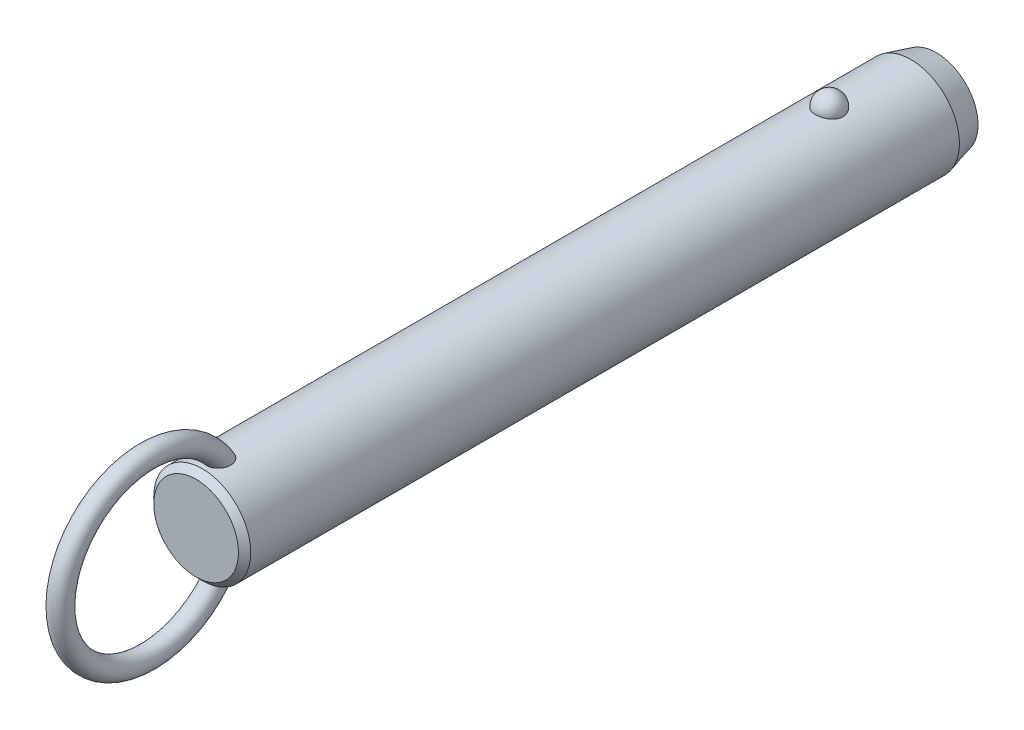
ISO-10303-21;
HEADER;
FILE_DESCRIPTION(('STEP AP214'),'2;1');
FILE_NAME('part.step','',(''),(''),'','','');
FILE_SCHEMA(('AUTOMOTIVE_DESIGN { 1 0 10303 214 1 1 1 1 }'));
ENDSEC;
DATA;
#1=APPLICATION_CONTEXT('core data for automotive mechanical design processes');
#2=APPLICATION_PROTOCOL_DEFINITION('international standard','automotive_design',2000,#1);
#3=PRODUCT_CONTEXT('',#1,'mechanical');
#4=PRODUCT('Part','Part','',(#3));
#5=PRODUCT_RELATED_PRODUCT_CATEGORY('part','',(#4));
#6=PRODUCT_DEFINITION_FORMATION('','',#4);
#7=PRODUCT_DEFINITION_CONTEXT('part definition',#1,'design');
#8=PRODUCT_DEFINITION('design','',#6,#7);
#9=PRODUCT_DEFINITION_SHAPE('','',#8);
#10=(LENGTH_UNIT() NAMED_UNIT(*) SI_UNIT(.MILLI.,.METRE.));
#11=(NAMED_UNIT(*) PLANE_ANGLE_UNIT() SI_UNIT($,.RADIAN.));
#12=(NAMED_UNIT(*) SI_UNIT($,.STERADIAN.) SOLID_ANGLE_UNIT());
#13=UNCERTAINTY_MEASURE_WITH_UNIT(LENGTH_MEASURE(1.E-05),#10,'distance_accuracy_value','');
#14=(GEOMETRIC_REPRESENTATION_CONTEXT(3) GLOBAL_UNCERTAINTY_ASSIGNED_CONTEXT((#13)) GLOBAL_UNIT_ASSIGNED_CONTEXT((#10,
#11,#12)) REPRESENTATION_CONTEXT('',''));
#15=CARTESIAN_POINT('',(0.,0.,0.));
#16=DIRECTION('',(0.,0.,1.));
#17=DIRECTION('',(1.,0.,0.));
#18=AXIS2_PLACEMENT_3D('',#15,#16,#17);
#19=CARTESIAN_POINT('',(0.,0.,111.8));
#20=DIRECTION('',(0.,0.,-1.));
#21=DIRECTION('',(-1.,0.,0.));
#22=AXIS2_PLACEMENT_3D('',#19,#20,#21);
#23=CYLINDRICAL_SURFACE('',#22,9.5);
#24=CARTESIAN_POINT('',(2.67259918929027,9.11631578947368,-2.70000000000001));
#25=CARTESIAN_POINT('',(2.6725968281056,9.11631786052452,-2.54909854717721));
#26=CARTESIAN_POINT('',(2.66030567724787,9.11994722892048,-2.39816735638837));
#27=CARTESIAN_POINT('',(2.6114347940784,9.13405924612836,-2.10058568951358));
#28=CARTESIAN_POINT('',(2.57484658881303,9.14454428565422,-1.95393672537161));
#29=CARTESIAN_POINT('',(2.47830875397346,9.17117631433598,-1.66916069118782));
#30=CARTESIAN_POINT('',(2.41836936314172,9.18732082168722,-1.53102991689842));
#31=CARTESIAN_POINT('',(2.27661331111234,9.22346780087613,-1.26705393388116));
#32=CARTESIAN_POINT('',(2.19479699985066,9.24347021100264,-1.14120852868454));
#33=CARTESIAN_POINT('',(2.01085282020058,9.28522401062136,-0.904632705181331));
#34=CARTESIAN_POINT('',(1.90862396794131,9.30698376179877,-0.793982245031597));
#35=CARTESIAN_POINT('',(1.6867437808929,9.34973971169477,-0.591607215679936));
#36=CARTESIAN_POINT('',(1.56709244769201,9.37073591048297,-0.499882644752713));
#37=CARTESIAN_POINT('',(1.31393976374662,9.40956370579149,-0.338167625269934));
#38=CARTESIAN_POINT('',(1.18048026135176,9.42740444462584,-0.268113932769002));
#39=CARTESIAN_POINT('',(0.903154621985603,9.45799906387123,-0.151390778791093));
#40=CARTESIAN_POINT('',(0.759289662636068,9.47075351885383,-0.104718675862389));
#41=CARTESIAN_POINT('',(0.468074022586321,9.48956256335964,-0.0367633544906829));
#42=CARTESIAN_POINT('',(0.320836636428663,9.49573643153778,-0.0150275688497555));
#43=CARTESIAN_POINT('',(0.0246714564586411,9.50112183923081,0.00396199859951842));
#44=CARTESIAN_POINT('',(-0.124256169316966,9.50033406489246,0.00121819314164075));
#45=CARTESIAN_POINT('',(-0.417264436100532,9.4919475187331,-0.0284441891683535));
#46=CARTESIAN_POINT('',(-0.56138413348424,9.48444885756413,-0.0550074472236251));
#47=CARTESIAN_POINT('',(-0.842986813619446,9.46357853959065,-0.131064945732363));
#48=CARTESIAN_POINT('',(-0.980469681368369,9.450206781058,-0.180559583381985));
#49=CARTESIAN_POINT('',(-1.24585005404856,9.41890822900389,-0.301476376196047));
#50=CARTESIAN_POINT('',(-1.37368611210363,9.40095498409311,-0.373026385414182));
#51=CARTESIAN_POINT('',(-1.61552738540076,9.36242964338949,-0.536025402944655));
#52=CARTESIAN_POINT('',(-1.72953116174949,9.34185727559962,-0.627476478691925));
#53=CARTESIAN_POINT('',(-1.9429225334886,9.29984568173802,-0.829844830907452));
#54=CARTESIAN_POINT('',(-2.04198021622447,9.27839736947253,-0.94110821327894));
#55=CARTESIAN_POINT('',(-2.22026460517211,9.23735994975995,-1.17883414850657));
#56=CARTESIAN_POINT('',(-2.29948985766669,9.21777097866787,-1.30529781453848));
#57=CARTESIAN_POINT('',(-2.43697287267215,9.18238994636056,-1.57158566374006));
#58=CARTESIAN_POINT('',(-2.49497068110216,9.16664569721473,-1.71155057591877));
#59=CARTESIAN_POINT('',(-2.5872073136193,9.14104303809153,-1.99961197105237));
#60=CARTESIAN_POINT('',(-2.62144683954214,9.13118445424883,-2.14770821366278));
#61=CARTESIAN_POINT('',(-2.66521466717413,9.11850622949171,-2.44715424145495));
#62=CARTESIAN_POINT('',(-2.67484831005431,9.11565658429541,-2.59848735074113));
#63=CARTESIAN_POINT('',(-2.66946735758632,9.11723375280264,-2.90067317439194));
#64=CARTESIAN_POINT('',(-2.65445345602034,9.12166036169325,-3.05152590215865));
#65=CARTESIAN_POINT('',(-2.60029711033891,9.13724422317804,-3.34766110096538));
#66=CARTESIAN_POINT('',(-2.56127978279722,9.14836656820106,-3.49296833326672));
#67=CARTESIAN_POINT('',(-2.46018844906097,9.17606676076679,-3.77477535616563));
#68=CARTESIAN_POINT('',(-2.39811349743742,9.1926448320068,-3.9112747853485));
#69=CARTESIAN_POINT('',(-2.25202303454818,9.22952198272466,-4.17244273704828));
#70=CARTESIAN_POINT('',(-2.16788714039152,9.24984129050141,-4.29704106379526));
#71=CARTESIAN_POINT('',(-1.9799408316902,9.29188255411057,-4.53013066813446));
#72=CARTESIAN_POINT('',(-1.87612963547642,9.31360456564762,-4.63862130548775));
#73=CARTESIAN_POINT('',(-1.65105429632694,9.35612959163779,-4.8369029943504));
#74=CARTESIAN_POINT('',(-1.52972405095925,9.37692871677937,-4.92661991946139));
#75=CARTESIAN_POINT('',(-1.27318250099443,9.41518970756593,-5.08429106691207));
#76=CARTESIAN_POINT('',(-1.13797219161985,9.432651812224,-5.15224684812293));
#77=CARTESIAN_POINT('',(-0.859280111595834,9.46208255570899,-5.26371827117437));
#78=CARTESIAN_POINT('',(-0.715925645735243,9.47411833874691,-5.30753421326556));
#79=CARTESIAN_POINT('',(-0.423550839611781,9.4916822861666,-5.37076321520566));
#80=CARTESIAN_POINT('',(-0.2745312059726,9.49721125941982,-5.39017930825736));
#81=CARTESIAN_POINT('',(0.0218446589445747,9.50110860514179,-5.40390587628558));
#82=CARTESIAN_POINT('',(0.16917707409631,9.49961381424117,-5.39869609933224));
#83=CARTESIAN_POINT('',(0.460808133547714,9.48993906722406,-5.36441955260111));
#84=CARTESIAN_POINT('',(0.605106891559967,9.48175936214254,-5.33535367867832));
#85=CARTESIAN_POINT('',(0.886027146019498,9.4596376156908,-5.25435587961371));
#86=CARTESIAN_POINT('',(1.02267710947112,9.44571881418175,-5.20251612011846));
#87=CARTESIAN_POINT('',(1.28523827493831,9.41358993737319,-5.07741549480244));
#88=CARTESIAN_POINT('',(1.41114877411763,9.39537958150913,-5.00415322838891));
#89=CARTESIAN_POINT('',(1.65085227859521,9.3562644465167,-4.83684599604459));
#90=CARTESIAN_POINT('',(1.76442346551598,9.33532178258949,-4.74249218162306));
#91=CARTESIAN_POINT('',(1.97425672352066,9.29321198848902,-4.53620389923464));
#92=CARTESIAN_POINT('',(2.07051582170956,9.27204482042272,-4.42426641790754));
#93=CARTESIAN_POINT('',(2.24490086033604,9.23139221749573,-4.18363183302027));
#94=CARTESIAN_POINT('',(2.32267019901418,9.21194380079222,-4.05466990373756));
#95=CARTESIAN_POINT('',(2.45584092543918,9.1773419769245,-3.78517836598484));
#96=CARTESIAN_POINT('',(2.5112497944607,9.16218713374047,-3.64465264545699));
#97=CARTESIAN_POINT('',(2.59380876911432,9.13913522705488,-3.37104301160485));
#98=CARTESIAN_POINT('',(2.62330266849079,9.13064624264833,-3.23871053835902));
#99=CARTESIAN_POINT('',(2.66269870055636,9.11923566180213,-2.97092664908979));
#100=CARTESIAN_POINT('',(2.67260130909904,9.11631393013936,-2.83547530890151));
#101=CARTESIAN_POINT('',(2.67259918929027,9.11631578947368,-2.70000000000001));
#102=B_SPLINE_CURVE_WITH_KNOTS('',3,(#24,#25,#26,#27,#28,#29,#30,#31,#32,#33,#34,#35,#36,#37,
#38,#39,#40,#41,#42,#43,#44,#45,#46,#47,#48,#49,#50,#51,#52,#53,#54,#55,#56,#57,#58,#59,#60,#61,
#62,#63,#64,#65,#66,#67,#68,#69,#70,#71,#72,#73,#74,#75,#76,#77,#78,#79,#80,#81,#82,#83,#84,#85,
#86,#87,#88,#89,#90,#91,#92,#93,#94,#95,#96,#97,#98,#99,#100,#101),.UNSPECIFIED.,.T.,.F.,(4,2,2,
2,2,2,2,2,2,2,2,2,2,2,2,2,2,2,2,2,2,2,2,2,2,2,2,2,2,2,2,2,2,2,2,2,2,2,4),(0.,0.452217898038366,
0.904593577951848,1.35677112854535,1.80894144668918,2.26340676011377,2.71787203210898,
3.17099820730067,3.62407318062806,4.0687883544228,4.51345969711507,4.95160616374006,
5.38976021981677,5.83050358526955,6.27129275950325,6.72071308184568,7.17016633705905,
7.62495278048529,8.07972578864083,8.53254856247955,8.98535859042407,9.43582813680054,
9.88631615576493,10.3393155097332,10.7923328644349,11.2471065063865,11.7018475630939,
12.150795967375,12.599688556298,13.0398725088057,13.4800399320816,13.9184421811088,
14.3568730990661,14.802202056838,15.2476074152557,15.7010097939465,16.1542603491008,
16.5602594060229,16.966248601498),.UNSPECIFIED.);
#103=CARTESIAN_POINT('',(2.67259918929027,9.11631578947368,-2.70000000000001));
#104=VERTEX_POINT('',#103);
#105=EDGE_CURVE('E41',#104,#104,#102,.T.);
#106=ORIENTED_EDGE('',*,*,#105,.T.);
#107=EDGE_LOOP('',(#106));
#108=FACE_BOUND('',#107,.T.);
#109=CARTESIAN_POINT('',(0.,0.,120.12));
#110=DIRECTION('',(0.,0.,1.));
#111=DIRECTION('',(1.,0.,0.));
#112=AXIS2_PLACEMENT_3D('',#109,#110,#111);
#113=CIRCLE('',#112,9.5);
#114=CARTESIAN_POINT('',(9.5,0.,120.12));
#115=VERTEX_POINT('',#114);
#116=EDGE_CURVE('E10',#115,#115,#113,.F.);
#117=ORIENTED_EDGE('',*,*,#116,.T.);
#118=EDGE_LOOP('',(#117));
#119=FACE_BOUND('',#118,.T.);
#120=CARTESIAN_POINT('',(-0.697062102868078,-9.47439269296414,114.467808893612));
#121=CARTESIAN_POINT('',(-0.799579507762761,-9.46685146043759,114.507482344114));
#122=CARTESIAN_POINT('',(-0.898575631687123,-9.45788043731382,114.5559309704));
#123=CARTESIAN_POINT('',(-1.08670047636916,-9.43811593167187,114.668868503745));
#124=CARTESIAN_POINT('',(-1.17583204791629,-9.42732297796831,114.733352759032));
#125=CARTESIAN_POINT('',(-1.34179806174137,-9.40513672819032,114.876209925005));
#126=CARTESIAN_POINT('',(-1.41865133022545,-9.39374438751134,114.954561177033));
#127=CARTESIAN_POINT('',(-1.55860047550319,-9.37154196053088,115.122752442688));
#128=CARTESIAN_POINT('',(-1.62169476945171,-9.3607319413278,115.21259377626));
#129=CARTESIAN_POINT('',(-1.73527695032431,-9.34035749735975,115.404500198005));
#130=CARTESIAN_POINT('',(-1.78522266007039,-9.33085270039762,115.506891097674));
#131=CARTESIAN_POINT('',(-1.86924997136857,-9.3143834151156,115.718148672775));
#132=CARTESIAN_POINT('',(-1.90332570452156,-9.30741986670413,115.827017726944));
#133=CARTESIAN_POINT('',(-1.95893603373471,-9.29588482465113,116.060473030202));
#134=CARTESIAN_POINT('',(-1.97872420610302,-9.29165182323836,116.185489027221));
#135=CARTESIAN_POINT('',(-2.00062129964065,-9.28695978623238,116.437080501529));
#136=CARTESIAN_POINT('',(-2.00272284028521,-9.28650232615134,116.563656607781));
#137=CARTESIAN_POINT('',(-1.98958876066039,-9.28932750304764,116.836815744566));
#138=CARTESIAN_POINT('',(-1.97143366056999,-9.2932400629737,116.983251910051));
#139=CARTESIAN_POINT('',(-1.91479925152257,-9.30507151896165,117.272062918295));
#140=CARTESIAN_POINT('',(-1.87629122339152,-9.31299607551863,117.414431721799));
#141=CARTESIAN_POINT('',(-1.7722568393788,-9.33340232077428,117.715172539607));
#142=CARTESIAN_POINT('',(-1.70334898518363,-9.34641636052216,117.872369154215));
#143=CARTESIAN_POINT('',(-1.58111062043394,-9.36759153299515,118.097517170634));
#144=CARTESIAN_POINT('',(-1.53721459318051,-9.37492619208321,118.170796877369));
#145=CARTESIAN_POINT('',(-1.4430263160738,-9.38988566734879,118.31307405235));
#146=CARTESIAN_POINT('',(-1.39273721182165,-9.39751033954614,118.382073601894));
#147=CARTESIAN_POINT('',(-1.26775962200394,-9.41530678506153,118.536983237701));
#148=CARTESIAN_POINT('',(-1.19052326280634,-9.42548108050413,118.620871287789));
#149=CARTESIAN_POINT('',(-1.0242024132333,-9.44499825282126,118.776008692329));
#150=CARTESIAN_POINT('',(-0.935139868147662,-9.45434261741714,118.847280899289));
#151=CARTESIAN_POINT('',(-0.766610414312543,-9.46930670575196,118.958695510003));
#152=CARTESIAN_POINT('',(-0.689439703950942,-9.47529223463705,119.002235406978));
#153=CARTESIAN_POINT('',(-0.528942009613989,-9.48560294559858,119.07631336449));
#154=CARTESIAN_POINT('',(-0.445620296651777,-9.48992953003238,119.106862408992));
#155=CARTESIAN_POINT('',(-0.273901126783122,-9.49644161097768,119.152579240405));
#156=CARTESIAN_POINT('',(-0.185465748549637,-9.49860811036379,119.16761059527));
#157=CARTESIAN_POINT('',(-0.00734541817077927,-9.5004135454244,119.180149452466));
#158=CARTESIAN_POINT('',(0.0823387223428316,-9.50005405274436,119.177667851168));
#159=CARTESIAN_POINT('',(0.247679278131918,-9.49708301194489,119.156995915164));
#160=CARTESIAN_POINT('',(0.32362017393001,-9.49477609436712,119.140930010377));
#161=CARTESIAN_POINT('',(0.47198153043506,-9.48855917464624,119.097172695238));
#162=CARTESIAN_POINT('',(0.54440029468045,-9.48464840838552,119.069475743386));
#163=CARTESIAN_POINT('',(0.708947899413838,-9.47398336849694,118.99280266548));
#164=CARTESIAN_POINT('',(0.799149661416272,-9.46671310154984,118.939774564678));
#165=CARTESIAN_POINT('',(0.969783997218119,-9.45076225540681,118.819973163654));
#166=CARTESIAN_POINT('',(1.05019415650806,-9.44207854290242,118.753169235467));
#167=CARTESIAN_POINT('',(1.23092343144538,-9.42051459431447,118.580759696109));
#168=CARTESIAN_POINT('',(1.32652499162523,-9.40733378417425,118.47026193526));
#169=CARTESIAN_POINT('',(1.49893121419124,-9.3814074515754,118.235561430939));
#170=CARTESIAN_POINT('',(1.57571616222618,-9.36866239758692,118.111344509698));
#171=CARTESIAN_POINT('',(1.71285426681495,-9.34457644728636,117.849389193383));
#172=CARTESIAN_POINT('',(1.7726636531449,-9.33328726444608,117.71136233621));
#173=CARTESIAN_POINT('',(1.87239208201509,-9.31379209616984,117.428051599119));
#174=CARTESIAN_POINT('',(1.91230158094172,-9.3055875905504,117.282764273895));
#175=CARTESIAN_POINT('',(1.97604189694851,-9.29228394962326,116.962028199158));
#176=CARTESIAN_POINT('',(1.99587438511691,-9.28797202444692,116.785724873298));
#177=CARTESIAN_POINT('',(2.0029570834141,-9.28645519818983,116.432414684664));
#178=CARTESIAN_POINT('',(1.99025930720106,-9.28923895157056,116.255409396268));
#179=CARTESIAN_POINT('',(1.93735479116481,-9.30038134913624,115.956338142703));
#180=CARTESIAN_POINT('',(1.90576827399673,-9.30697680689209,115.832667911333));
#181=CARTESIAN_POINT('',(1.82287484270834,-9.32356855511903,115.592329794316));
#182=CARTESIAN_POINT('',(1.77158213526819,-9.33356239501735,115.475656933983));
#183=CARTESIAN_POINT('',(1.64885744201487,-9.35602275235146,115.252706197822));
#184=CARTESIAN_POINT('',(1.57730995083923,-9.36850332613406,115.146492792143));
#185=CARTESIAN_POINT('',(1.41543264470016,-9.39431873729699,114.949553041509));
#186=CARTESIAN_POINT('',(1.3251088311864,-9.40765330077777,114.858821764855));
#187=CARTESIAN_POINT('',(1.13846223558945,-9.43195720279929,114.705033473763));
#188=CARTESIAN_POINT('',(1.04369890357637,-9.44302894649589,114.640094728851));
#189=CARTESIAN_POINT('',(0.84396568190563,-9.46296805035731,114.528038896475));
#190=CARTESIAN_POINT('',(0.73900000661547,-9.4718363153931,114.480914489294));
#191=CARTESIAN_POINT('',(0.528175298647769,-9.48586140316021,114.408117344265));
#192=CARTESIAN_POINT('',(0.422686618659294,-9.49119633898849,114.38140249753));
#193=CARTESIAN_POINT('',(0.208590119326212,-9.49831365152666,114.346013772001));
#194=CARTESIAN_POINT('',(0.0999817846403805,-9.500095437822,114.337342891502));
#195=CARTESIAN_POINT('',(-0.126104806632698,-9.49988861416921,114.338350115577));
#196=CARTESIAN_POINT('',(-0.243578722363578,-9.49757821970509,114.349594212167));
#197=CARTESIAN_POINT('',(-0.474390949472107,-9.48885165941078,114.393167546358));
#198=CARTESIAN_POINT('',(-0.587729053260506,-9.48243528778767,114.425497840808));
#199=CARTESIAN_POINT('',(-0.697062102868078,-9.47439269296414,114.467808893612));
#200=B_SPLINE_CURVE_WITH_KNOTS('',3,(#120,#121,#122,#123,#124,#125,#126,#127,#128,#129,#130,
#131,#132,#133,#134,#135,#136,#137,#138,#139,#140,#141,#142,#143,#144,#145,#146,#147,#148,#149,
#150,#151,#152,#153,#154,#155,#156,#157,#158,#159,#160,#161,#162,#163,#164,#165,#166,#167,#168,
#169,#170,#171,#172,#173,#174,#175,#176,#177,#178,#179,#180,#181,#182,#183,#184,#185,#186,#187,
#188,#189,#190,#191,#192,#193,#194,#195,#196,#197,#198,#199),.UNSPECIFIED.,.T.,.F.,(4,2,2,2,2,2,
2,2,2,2,2,2,2,2,2,2,2,2,2,2,2,2,2,2,2,2,2,2,2,2,2,2,2,2,2,2,2,2,2,4),(0.,0.330119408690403,
0.660143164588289,0.98965593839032,1.31920659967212,1.66074728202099,2.00241415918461,
2.3808869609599,2.7595176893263,3.20065679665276,3.64242004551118,4.15620996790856,
4.41314162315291,4.66994734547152,5.0122866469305,5.35399933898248,5.61943037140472,
5.88463652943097,6.15215502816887,6.41950709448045,6.6514439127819,6.88349136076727,
7.19641200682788,7.51003602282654,7.94779711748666,8.38601491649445,8.8369970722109,
9.28819530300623,9.81778662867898,10.3465317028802,10.7284172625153,11.1100280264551,
11.4938603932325,11.8775702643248,12.2220189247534,12.5663259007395,12.8915939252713,
13.2169159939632,13.5689650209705,13.9210316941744),.UNSPECIFIED.);
#201=CARTESIAN_POINT('',(-0.697062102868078,-9.47439269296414,114.467808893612));
#202=VERTEX_POINT('',#201);
#203=EDGE_CURVE('E60',#202,#202,#200,.T.);
#204=ORIENTED_EDGE('',*,*,#203,.T.);
#205=EDGE_LOOP('',(#204));
#206=FACE_BOUND('',#205,.T.);
#207=CARTESIAN_POINT('',(-0.697062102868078,9.47439269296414,114.467808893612));
#208=CARTESIAN_POINT('',(-0.597792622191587,9.48169483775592,114.42939564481));
#209=CARTESIAN_POINT('',(-0.495106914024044,9.48766580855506,114.399168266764));
#210=CARTESIAN_POINT('',(-0.285876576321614,9.49627648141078,114.356032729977));
#211=CARTESIAN_POINT('',(-0.179324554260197,9.49890941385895,114.343159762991));
#212=CARTESIAN_POINT('',(0.0344157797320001,9.50053798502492,114.335166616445));
#213=CARTESIAN_POINT('',(0.141603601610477,9.49953613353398,114.340034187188));
#214=CARTESIAN_POINT('',(0.353563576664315,9.49401038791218,114.367365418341));
#215=CARTESIAN_POINT('',(0.458336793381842,9.48948807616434,114.38982117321));
#216=CARTESIAN_POINT('',(0.66249373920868,9.4774236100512,114.451671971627));
#217=CARTESIAN_POINT('',(0.761881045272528,9.46988348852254,114.491055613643));
#218=CARTESIAN_POINT('',(0.952608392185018,9.45260382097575,114.585634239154));
#219=CARTESIAN_POINT('',(1.04394806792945,9.44286417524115,114.640829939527));
#220=CARTESIAN_POINT('',(1.21712767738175,9.4221176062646,114.766066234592));
#221=CARTESIAN_POINT('',(1.29885671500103,9.41109835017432,114.836257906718));
#222=CARTESIAN_POINT('',(1.4497897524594,9.38903310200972,114.988980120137));
#223=CARTESIAN_POINT('',(1.51899278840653,9.37798710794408,115.071511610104));
#224=CARTESIAN_POINT('',(1.64602857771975,9.35654375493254,115.249776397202));
#225=CARTESIAN_POINT('',(1.70333052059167,9.34618688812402,115.345891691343));
#226=CARTESIAN_POINT('',(1.80259341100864,9.32755128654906,115.545897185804));
#227=CARTESIAN_POINT('',(1.84454942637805,9.31927322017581,115.649789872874));
#228=CARTESIAN_POINT('',(1.91637039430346,9.30478365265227,115.872213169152));
#229=CARTESIAN_POINT('',(1.944805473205,9.29882552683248,115.991219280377));
#230=CARTESIAN_POINT('',(1.98449865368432,9.29043398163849,116.232143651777));
#231=CARTESIAN_POINT('',(1.99574908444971,9.28800213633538,116.354063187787));
#232=CARTESIAN_POINT('',(2.00275141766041,9.28649645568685,116.616932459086));
#233=CARTESIAN_POINT('',(1.99588238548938,9.28799035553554,116.757952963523));
#234=CARTESIAN_POINT('',(1.96270559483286,9.29505517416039,117.037621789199));
#235=CARTESIAN_POINT('',(1.93637872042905,9.30063010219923,117.176267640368));
#236=CARTESIAN_POINT('',(1.85949176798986,9.31633564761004,117.472561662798));
#237=CARTESIAN_POINT('',(1.80549792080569,9.3270926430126,117.629290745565));
#238=CARTESIAN_POINT('',(1.67376869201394,9.3516306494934,117.932284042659));
#239=CARTESIAN_POINT('',(1.5960318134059,9.36541185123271,118.078547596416));
#240=CARTESIAN_POINT('',(1.4360277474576,9.39110706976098,118.325813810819));
#241=CARTESIAN_POINT('',(1.35831795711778,9.40278656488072,118.429791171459));
#242=CARTESIAN_POINT('',(1.18774483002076,9.42585025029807,118.624534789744));
#243=CARTESIAN_POINT('',(1.09490932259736,9.43723493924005,118.715324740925));
#244=CARTESIAN_POINT('',(0.921110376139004,9.45552616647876,118.85620334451));
#245=CARTESIAN_POINT('',(0.843738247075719,9.46281058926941,118.910656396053));
#246=CARTESIAN_POINT('',(0.681245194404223,9.47589120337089,119.006711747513));
#247=CARTESIAN_POINT('',(0.596135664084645,9.48168953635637,119.048332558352));
#248=CARTESIAN_POINT('',(0.433779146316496,9.49038144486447,119.110089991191));
#249=CARTESIAN_POINT('',(0.35745955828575,9.49359170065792,119.13260136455));
#250=CARTESIAN_POINT('',(0.202074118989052,9.49816761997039,119.164574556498));
#251=CARTESIAN_POINT('',(0.123010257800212,9.49953459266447,119.174045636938));
#252=CARTESIAN_POINT('',(-0.0357372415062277,9.50026497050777,119.179114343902));
#253=CARTESIAN_POINT('',(-0.115421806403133,9.49962433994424,119.174684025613));
#254=CARTESIAN_POINT('',(-0.272823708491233,9.49640854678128,119.152296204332));
#255=CARTESIAN_POINT('',(-0.350540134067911,9.4938325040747,119.134332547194));
#256=CARTESIAN_POINT('',(-0.500580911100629,9.4870946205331,119.086802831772));
#257=CARTESIAN_POINT('',(-0.572979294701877,9.48296359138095,119.057461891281));
#258=CARTESIAN_POINT('',(-0.712864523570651,9.47347609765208,118.989008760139));
#259=CARTESIAN_POINT('',(-0.780349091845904,9.46811906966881,118.949892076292));
#260=CARTESIAN_POINT('',(-0.946309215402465,9.45329720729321,118.839432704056));
#261=CARTESIAN_POINT('',(-1.04090230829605,9.44321512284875,118.762329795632));
#262=CARTESIAN_POINT('',(-1.21661929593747,9.42219227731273,118.59409718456));
#263=CARTESIAN_POINT('',(-1.29770519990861,9.41124921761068,118.502929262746));
#264=CARTESIAN_POINT('',(-1.4731964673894,9.38563439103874,118.276162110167));
#265=CARTESIAN_POINT('',(-1.56208878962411,9.37102009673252,118.136289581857));
#266=CARTESIAN_POINT('',(-1.71623987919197,9.34401559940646,117.843950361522));
#267=CARTESIAN_POINT('',(-1.78147866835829,9.33162728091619,117.691473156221));
#268=CARTESIAN_POINT('',(-1.88853837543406,9.31055541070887,117.375647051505));
#269=CARTESIAN_POINT('',(-1.92998995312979,9.30193076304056,117.212168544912));
#270=CARTESIAN_POINT('',(-1.98590726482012,9.29015757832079,116.880526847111));
#271=CARTESIAN_POINT('',(-2.00040705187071,9.2870021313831,116.712369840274));
#272=CARTESIAN_POINT('',(-1.99964701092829,9.28716218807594,116.405080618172));
#273=CARTESIAN_POINT('',(-1.98908145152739,9.28945704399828,116.265936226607));
#274=CARTESIAN_POINT('',(-1.94566294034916,9.29865169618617,115.991153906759));
#275=CARTESIAN_POINT('',(-1.91282062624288,9.30554929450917,115.855514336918));
#276=CARTESIAN_POINT('',(-1.84582133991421,9.31898248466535,115.657802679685));
#277=CARTESIAN_POINT('',(-1.8203808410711,9.32400364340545,115.592583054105));
#278=CARTESIAN_POINT('',(-1.76350511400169,9.33492884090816,115.464903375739));
#279=CARTESIAN_POINT('',(-1.7320730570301,9.3408324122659,115.402441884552));
#280=CARTESIAN_POINT('',(-1.66324243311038,9.353333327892,115.28094078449));
#281=CARTESIAN_POINT('',(-1.62584239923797,9.35993084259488,115.221902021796));
#282=CARTESIAN_POINT('',(-1.545276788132,9.37356864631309,115.107987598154));
#283=CARTESIAN_POINT('',(-1.50211241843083,9.38060884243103,115.053111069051));
#284=CARTESIAN_POINT('',(-1.37681147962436,9.40004442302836,114.909961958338));
#285=CARTESIAN_POINT('',(-1.28916358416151,9.41261047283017,114.826429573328));
#286=CARTESIAN_POINT('',(-1.09996826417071,9.43658180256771,114.677236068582));
#287=CARTESIAN_POINT('',(-0.998461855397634,9.44799034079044,114.611523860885));
#288=CARTESIAN_POINT('',(-0.860188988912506,9.46103017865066,114.5394367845));
#289=CARTESIAN_POINT('',(-0.828141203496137,9.46389141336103,114.523851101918));
#290=CARTESIAN_POINT('',(-0.763210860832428,9.46934915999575,114.494473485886));
#291=CARTESIAN_POINT('',(-0.730328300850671,9.47194567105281,114.480681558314));
#292=CARTESIAN_POINT('',(-0.697062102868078,9.47439269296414,114.467808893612));
#293=B_SPLINE_CURVE_WITH_KNOTS('',3,(#207,#208,#209,#210,#211,#212,#213,#214,#215,#216,#217,
#218,#219,#220,#221,#222,#223,#224,#225,#226,#227,#228,#229,#230,#231,#232,#233,#234,#235,#236,
#237,#238,#239,#240,#241,#242,#243,#244,#245,#246,#247,#248,#249,#250,#251,#252,#253,#254,#255,
#256,#257,#258,#259,#260,#261,#262,#263,#264,#265,#266,#267,#268,#269,#270,#271,#272,#273,#274,
#275,#276,#277,#278,#279,#280,#281,#282,#283,#284,#285,#286,#287,#288,#289,#290,#291,#292),
.UNSPECIFIED.,.T.,.F.,(4,2,2,2,2,2,2,2,2,2,2,2,2,2,2,2,2,2,2,2,2,2,2,2,2,2,2,2,2,2,2,2,2,2,2,2,
2,2,2,2,2,2,4),(0.,0.319942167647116,0.640532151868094,0.96090081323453,1.28112555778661,
1.60113495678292,1.92115886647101,2.24457323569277,2.56801248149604,2.90371927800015,
3.23953387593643,3.60560313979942,3.97183576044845,4.39383693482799,4.81625324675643,
5.31257045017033,5.80891895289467,6.19868344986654,6.58773876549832,6.87145417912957,
7.15475838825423,7.3926375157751,7.63034760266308,7.86853584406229,8.10683246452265,
8.34063661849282,8.57454843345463,8.93983939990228,9.30614105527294,9.80266668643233,
10.2996107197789,10.8040753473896,11.3079021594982,11.7249776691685,12.1418541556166,
12.3521485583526,12.562331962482,12.7725671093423,12.9827582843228,13.3458276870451,
13.7078449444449,13.8150604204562,13.9222762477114),.UNSPECIFIED.);
#294=CARTESIAN_POINT('',(-0.697062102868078,9.47439269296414,114.467808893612));
#295=VERTEX_POINT('',#294);
#296=EDGE_CURVE('E68',#295,#295,#293,.T.);
#297=ORIENTED_EDGE('',*,*,#296,.T.);
#298=EDGE_LOOP('',(#297));
#299=FACE_BOUND('',#298,.T.);
#300=CARTESIAN_POINT('',(0.,0.,-18.6999999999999));
#301=DIRECTION('',(0.,0.,-1.));
#302=DIRECTION('',(-1.,0.,0.));
#303=AXIS2_PLACEMENT_3D('',#300,#301,#302);
#304=CIRCLE('',#303,9.5);
#305=CARTESIAN_POINT('',(-9.5,0.,-18.6999999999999));
#306=VERTEX_POINT('',#305);
#307=EDGE_CURVE('E57',#306,#306,#304,.F.);
#308=ORIENTED_EDGE('',*,*,#307,.T.);
#309=EDGE_LOOP('',(#308));
#310=FACE_BOUND('',#309,.T.);
#311=ADVANCED_FACE('F37',(#108,#119,#206,#299,#310),#23,.T.);
#312=CARTESIAN_POINT('',(0.,0.,-23.7));
#313=DIRECTION('',(0.,0.,-1.));
#314=DIRECTION('',(-1.,0.,0.));
#315=AXIS2_PLACEMENT_3D('',#312,#313,#314);
#316=PLANE('',#315);
#317=CARTESIAN_POINT('',(0.,0.,-23.7));
#318=DIRECTION('',(0.,0.,-1.));
#319=DIRECTION('',(-1.,0.,0.));
#320=AXIS2_PLACEMENT_3D('',#317,#318,#319);
#321=CIRCLE('',#320,8.16025403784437);
#322=CARTESIAN_POINT('',(-8.16025403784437,0.,-23.7));
#323=VERTEX_POINT('',#322);
#324=EDGE_CURVE('E67',#323,#323,#321,.T.);
#325=ORIENTED_EDGE('',*,*,#324,.T.);
#326=EDGE_LOOP('',(#325));
#327=FACE_BOUND('',#326,.T.);
#328=ADVANCED_FACE('F86',(#327),#316,.T.);
#329=CARTESIAN_POINT('',(0.,0.,-23.7));
#330=DIRECTION('',(0.,0.,1.));
#331=DIRECTION('',(1.,0.,0.));
#332=AXIS2_PLACEMENT_3D('',#329,#330,#331);
#333=CONICAL_SURFACE('',#332,8.16025403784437,0.261799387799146);
#334=ORIENTED_EDGE('',*,*,#307,.F.);
#335=EDGE_LOOP('',(#334));
#336=FACE_BOUND('',#335,.T.);
#337=ORIENTED_EDGE('',*,*,#324,.F.);
#338=EDGE_LOOP('',(#337));
#339=FACE_BOUND('',#338,.T.);
#340=ADVANCED_FACE('F84',(#336,#339),#333,.T.);
#341=CARTESIAN_POINT('',(0.,0.,121.32));
#342=DIRECTION('',(0.,0.,1.));
#343=DIRECTION('',(1.,0.,0.));
#344=AXIS2_PLACEMENT_3D('',#341,#342,#343);
#345=PLANE('',#344);
#346=CARTESIAN_POINT('',(0.,0.,121.32));
#347=DIRECTION('',(0.,0.,1.));
#348=DIRECTION('',(1.,0.,0.));
#349=AXIS2_PLACEMENT_3D('',#346,#347,#348);
#350=CIRCLE('',#349,8.30000000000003);
#351=CARTESIAN_POINT('',(8.30000000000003,0.,121.32));
#352=VERTEX_POINT('',#351);
#353=EDGE_CURVE('E50',#352,#352,#350,.T.);
#354=ORIENTED_EDGE('',*,*,#353,.T.);
#355=EDGE_LOOP('',(#354));
#356=FACE_BOUND('',#355,.T.);
#357=ADVANCED_FACE('F78',(#356),#345,.T.);
#358=CARTESIAN_POINT('',(0.,0.,130.85));
#359=DIRECTION('',(1.,0.,0.));
#360=DIRECTION('',(0.,0.,-1.));
#361=AXIS2_PLACEMENT_3D('',#358,#359,#360);
#362=TOROIDAL_SURFACE('',#361,17.05,2.);
#363=ORIENTED_EDGE('',*,*,#296,.F.);
#364=EDGE_LOOP('',(#363));
#365=FACE_BOUND('',#364,.T.);
#366=ORIENTED_EDGE('',*,*,#203,.F.);
#367=EDGE_LOOP('',(#366));
#368=FACE_BOUND('',#367,.T.);
#369=ADVANCED_FACE('F74',(#365,#368),#362,.T.);
#370=CARTESIAN_POINT('',(0.,0.,121.32));
#371=DIRECTION('',(0.,0.,-1.));
#372=DIRECTION('',(-1.,0.,0.));
#373=AXIS2_PLACEMENT_3D('',#370,#371,#372);
#374=CONICAL_SURFACE('',#373,8.30000000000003,0.785398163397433);
#375=ORIENTED_EDGE('',*,*,#116,.F.);
#376=EDGE_LOOP('',(#375));
#377=FACE_BOUND('',#376,.T.);
#378=ORIENTED_EDGE('',*,*,#353,.F.);
#379=EDGE_LOOP('',(#378));
#380=FACE_BOUND('',#379,.T.);
#381=ADVANCED_FACE('F39',(#377,#380),#374,.T.);
#382=CARTESIAN_POINT('',(0.,9.5,-2.70000000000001));
#383=DIRECTION('',(0.,1.,0.));
#384=DIRECTION('',(0.,0.,-1.));
#385=AXIS2_PLACEMENT_3D('',#382,#383,#384);
#386=SPHERICAL_SURFACE('',#385,2.7);
#387=ORIENTED_EDGE('',*,*,#105,.F.);
#388=EDGE_LOOP('',(#387));
#389=FACE_BOUND('',#388,.T.);
#390=ADVANCED_FACE('F80',(#389),#386,.T.);
#391=CLOSED_SHELL('',(#311,#328,#340,#357,#369,#381,#390));
#392=MANIFOLD_SOLID_BREP('B2',#391);
#393=ADVANCED_BREP_SHAPE_REPRESENTATION('',(#18,#392),#14);
#394=SHAPE_DEFINITION_REPRESENTATION(#9,#393);
ENDSEC;
END-ISO-10303-21;
